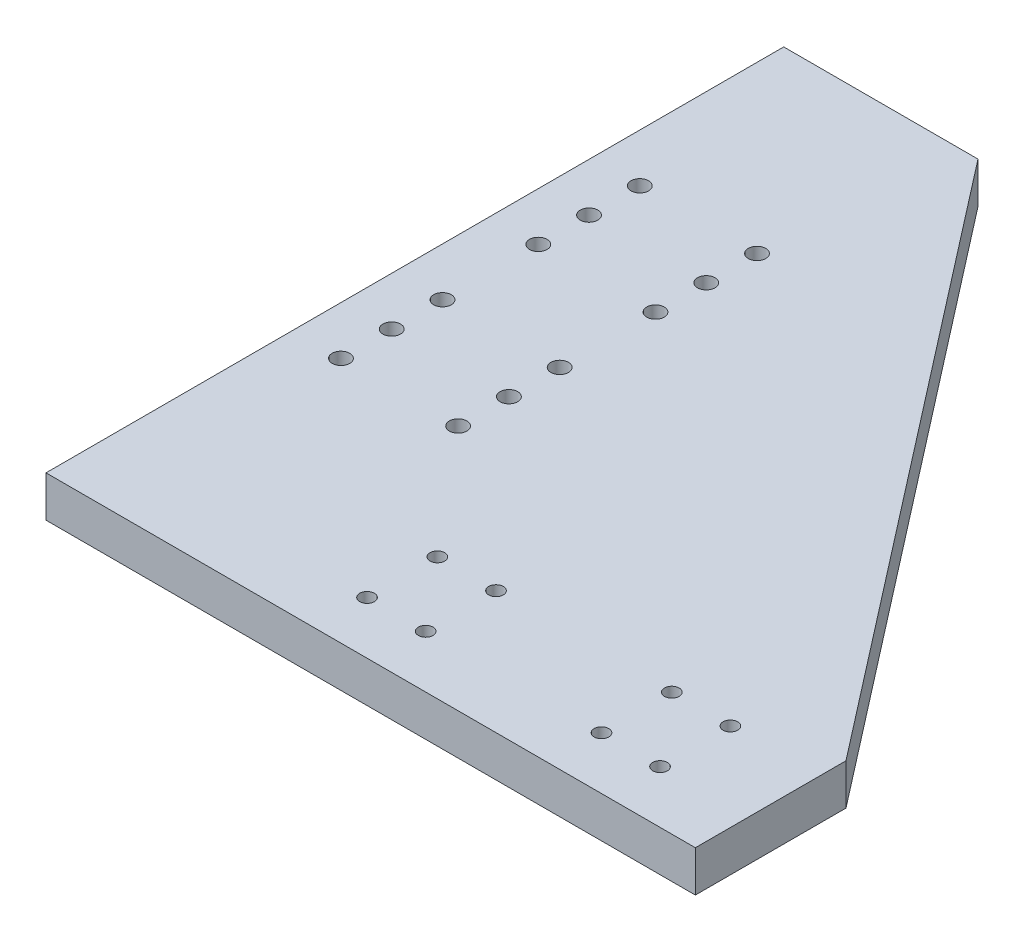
from build123d import *

# Parameters (mm, degrees)
BOSS_EXTRUDE1_DEPTH = 88.9
SKETCH4_R           = 15.875
SKETCH4_R_2         = 19.05
CUT_EXTRUDE1_DEPTH  = 1245.274625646


with BuildPart() as part:
    # Sketch3 → Boss-Extrude1 (new body)
    with BuildSketch(Plane(origin=(0, 0, 0), x_dir=(-1, 0, 0), z_dir=(0, 1, 0))):
        Polygon((-882.49650001, 726.251123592), (524.87815905, 726.251123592), (524.87815905, -872.648876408), (103.79099999, -872.648876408), (-882.49650001, 399.797023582), align=None)
    extrude(amount=BOSS_EXTRUDE1_DEPTH)

    # Sketch4 → Cut-Extrude1 (cut, through all)
    with BuildSketch(Plane(origin=(0, 0, 0), x_dir=(-1, 0, 0), z_dir=(0, 1, 0))):
        with Locations(Location((-691.99650001, 459.82202359, 0), (0, 0, 90))):
            Circle(SKETCH4_R)
        with Locations(Location((-691.99650001, 612.22202359, 0), (0, 0, 90))):
            Circle(SKETCH4_R)
        with Locations(Location((-56.99650001, 459.82202359, 0), (0, 0, 90))):
            Circle(SKETCH4_R)
        with Locations(Location((-56.99650001, 612.22202359, 0), (0, 0, 90))):
            Circle(SKETCH4_R)
        with Locations(Location((-564.99650001, 459.82202359, 0), (0, 0, 90))):
            Circle(SKETCH4_R)
        with Locations(Location((-564.99650001, 612.22202359, 0), (0, 0, 90))):
            Circle(SKETCH4_R)
        with Locations(Location((-183.99650001, 459.82202359, 0), (0, 0, 90))):
            Circle(SKETCH4_R)
        with Locations(Location((-183.99650001, 612.22202359, 0), (0, 0, 90))):
            Circle(SKETCH4_R)
        with Locations(Location((166.11599999, 191.72612359, 0), (0, 0, 90))):
            Circle(SKETCH4_R_2)
        with Locations(Location((420.11599999, 191.72612359, 0), (0, 0, 90))):
            Circle(SKETCH4_R_2)
        with Locations(Location((166.11599999, -455.97387641, 0), (0, 0, 90))):
            Circle(SKETCH4_R_2)
        with Locations(Location((420.11599999, -455.97387641, 0), (0, 0, 90))):
            Circle(SKETCH4_R_2)
        with Locations(Location((166.11599999, 81.72612359, 0), (0, 0, 90))):
            Circle(SKETCH4_R_2)
        with Locations(Location((420.11599999, 81.72612359, 0), (0, 0, 90))):
            Circle(SKETCH4_R_2)
        with Locations(Location((166.11599999, -345.97387641, 0), (0, 0, 90))):
            Circle(SKETCH4_R_2)
        with Locations(Location((420.11599999, -345.97387641, 0), (0, 0, 90))):
            Circle(SKETCH4_R_2)
        with Locations(Location((166.11599999, -28.27387641, 0), (0, 0, 90))):
            Circle(SKETCH4_R_2)
        with Locations(Location((420.11599999, -28.27387641, 0), (0, 0, 90))):
            Circle(SKETCH4_R_2)
        with Locations(Location((166.11599999, -235.97387641, 0), (0, 0, 90))):
            Circle(SKETCH4_R_2)
        with Locations(Location((420.11599999, -235.97387641, 0), (0, 0, 90))):
            Circle(SKETCH4_R_2)
    extrude(amount=CUT_EXTRUDE1_DEPTH, mode=Mode.SUBTRACT)


solid = part.part
